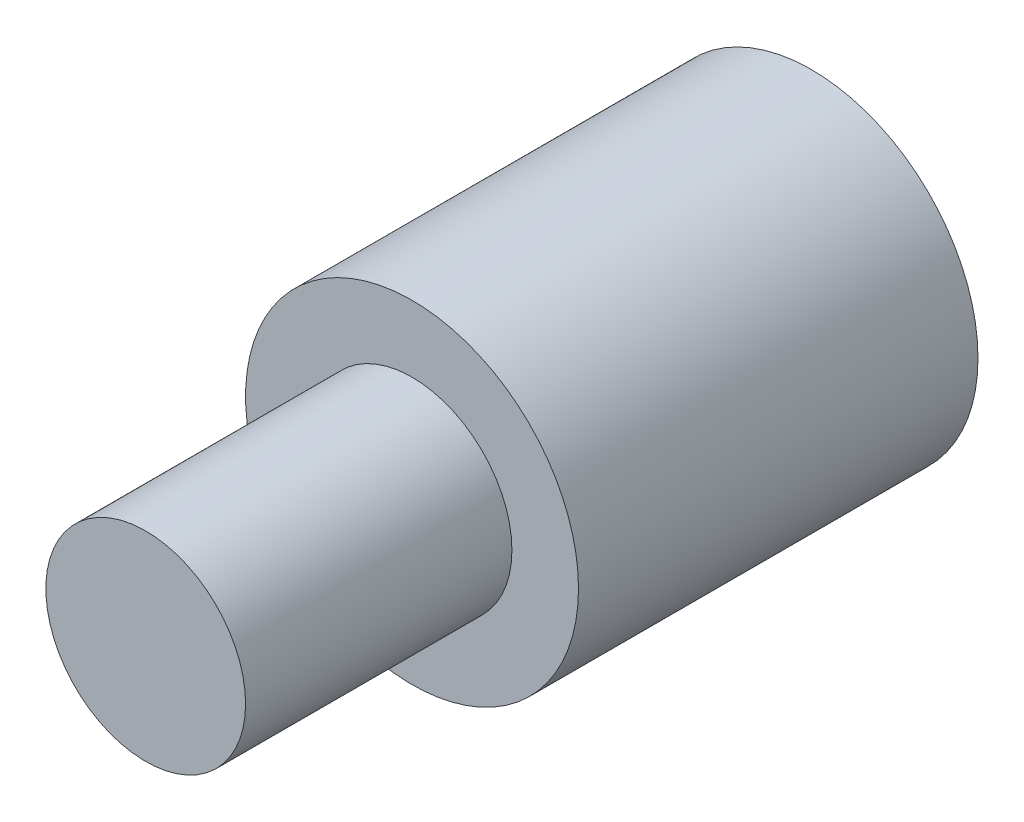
from build123d import *

# Parameters (mm, degrees)
ESQUISSE1_R               = 2.5
EXTRUSION1_DEPTH          = 6
ESQUISSE2_R               = 1.5
EXTRUSION2_DEPTH          = 4
TROU_TARAUD_M3X0_51_D     = 2.5
TROU_TARAUD_M3X0_51_DEPTH = 7.5
TROU_TARAUD_M3X0_51_TIP   = 0.751075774


with BuildPart() as part:
    # Esquisse1 → Extrusion1 (new body)
    with BuildSketch(Plane.XY):
        Circle(ESQUISSE1_R)
    extrude(amount=EXTRUSION1_DEPTH)

    # Esquisse2 → Extrusion2 (add)
    with BuildSketch(Plane.XY.offset(6)):
        Circle(ESQUISSE2_R)
    extrude(amount=EXTRUSION2_DEPTH)

    # Trou taraud_ M3x0.51
    with Locations(Plane(origin=(0, 0, 0), x_dir=(-1, 0, 0), z_dir=(0, 0, -1))):
        with Locations((0, 0)):
            Hole(TROU_TARAUD_M3X0_51_D / 2, depth=TROU_TARAUD_M3X0_51_DEPTH)
            with Locations((0, 0, -(TROU_TARAUD_M3X0_51_DEPTH + TROU_TARAUD_M3X0_51_TIP / 2))):  # 118° drill point
                Cone(0, TROU_TARAUD_M3X0_51_D / 2, TROU_TARAUD_M3X0_51_TIP, mode=Mode.SUBTRACT)


solid = part.part
